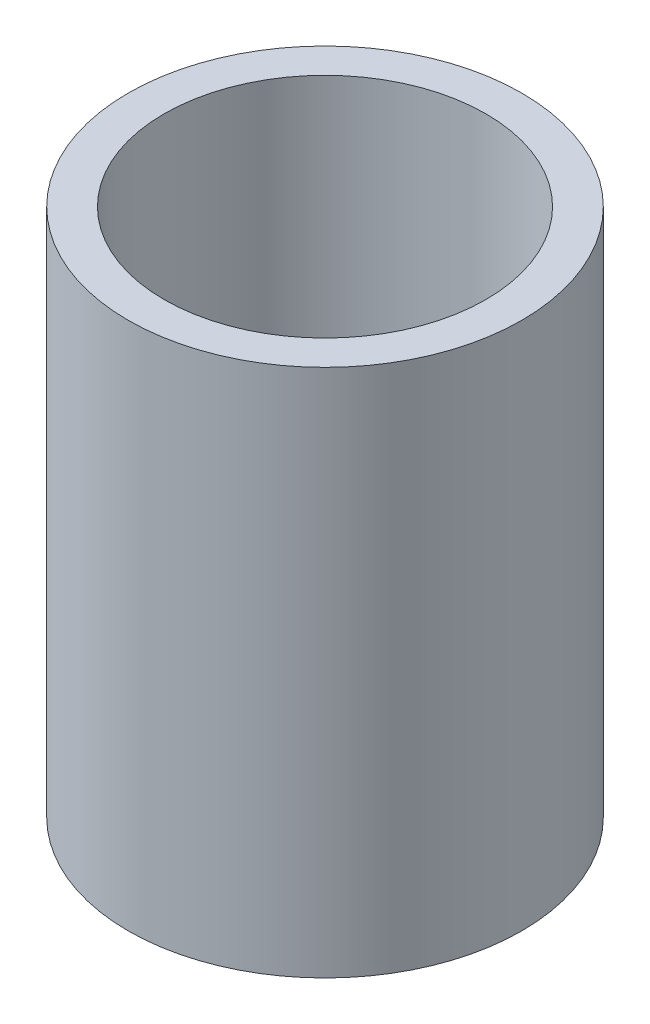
from build123d import *


with BuildPart() as part:
    # Sketch1 → Revolve1 (revolve)
    with BuildSketch(Plane.XY, mode=Mode.PRIVATE) as revolve1_sk:
        Polygon((8.001, 1.190625), (8.001, -1.190625), (10.8204, -1.190625), (10.8204, -17.78), (13.2334, -17.78), (13.2334, 17.78), (10.8204, 17.78), (10.8204, 1.190625), align=None)
    revolve(revolve1_sk.sketch.rotate(Axis((0, 17.78, 0), (0, -1, 0)), 270), axis=Axis((0, 17.78, 0), (0, -1, 0)))


solid = part.part
